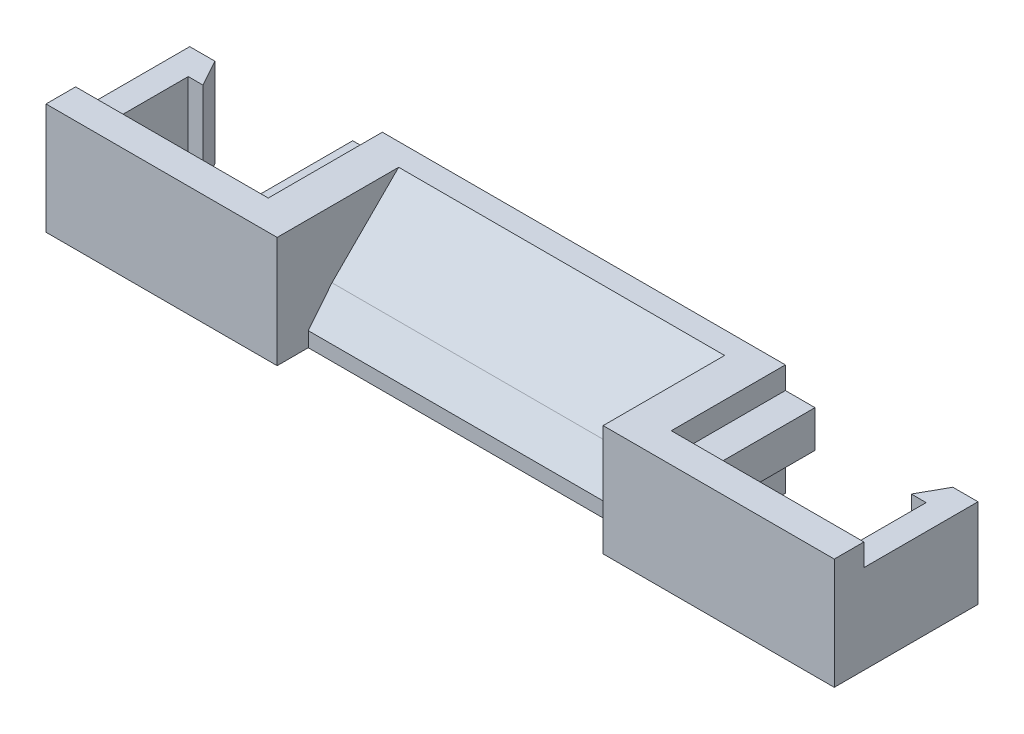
from build123d import *

# Parameters (mm, degrees)
CROQUIS1_W              = 27.2
CROQUIS1_H              = 7.5
SALIENTE_EXTRUIR1_DEPTH = 9.7
CORTAR_EXTRUIR1_DEPTH   = 22
CROQUIS6_W              = 9.7
CROQUIS6_H              = 2.5
SALIENTE_EXTRUIR2_DEPTH = 2
CROQUIS7_W              = 9.7
CROQUIS7_H              = 2.5
SALIENTE_EXTRUIR3_DEPTH = 2
CROQUIS8_W              = 2
CROQUIS8_H              = 7.5
SALIENTE_EXTRUIR4_DEPTH = 13
CROQUIS9_W              = 2
CROQUIS9_H              = 7.5
SALIENTE_EXTRUIR5_DEPTH = 13
CROQUIS11_W             = 1.7
CROQUIS11_H             = 6
SALIENTE_EXTRUIR7_DEPTH = 7.7
SALIENTE_EXTRUIR8_DEPTH = 6


with BuildPart() as part:
    # Croquis1 → Saliente-Extruir1 (new body)
    with BuildSketch(Plane.XY):
        with Locations((13.6, 3.75)):
            Rectangle(CROQUIS1_W, CROQUIS1_H)
    extrude(amount=SALIENTE_EXTRUIR1_DEPTH)

    # Croquis3 → Cortar-Extruir1 (cut)
    with BuildSketch(Plane(origin=(2.6, 0, 0), x_dir=(0, 0, -1), z_dir=(1, 0, 0))):
        Polygon((-7.6, 0), (-7.6, 1), (-6, 3), (-1.5, 7.5), (-1.5, 8.677486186), (-10.793726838, 8.677486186), (-10.793726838, -0.80173334), (-7.6, -0.80173334), align=None)
    extrude(amount=CORTAR_EXTRUIR1_DEPTH, mode=Mode.SUBTRACT)

    # Croquis6 → Saliente-Extruir2 (add)
    with BuildSketch(Plane(origin=(27.2, 0, 0), x_dir=(0, 0, -1), z_dir=(1, 0, 0))):
        with Locations((-4.85, 4.75)):
            Rectangle(CROQUIS6_W, CROQUIS6_H)
    extrude(amount=SALIENTE_EXTRUIR2_DEPTH)

    # Croquis7 → Saliente-Extruir3 (add)
    with BuildSketch(Plane.ZY):
        with Locations((4.85, 4.75)):
            Rectangle(CROQUIS7_W, CROQUIS7_H)
    extrude(amount=SALIENTE_EXTRUIR3_DEPTH)

    # Croquis8 → Saliente-Extruir4 (add)
    with BuildSketch(Plane(origin=(27.2, 0, 0), x_dir=(0, 0, -1), z_dir=(1, 0, 0))):
        with Locations((-8.7, 3.75)):
            Rectangle(CROQUIS8_W, CROQUIS8_H)
    extrude(amount=SALIENTE_EXTRUIR4_DEPTH)

    # Croquis9 → Saliente-Extruir5 (add)
    with BuildSketch(Plane.ZY):
        with Locations((8.7, 3.75)):
            Rectangle(CROQUIS9_W, CROQUIS9_H)
    extrude(amount=SALIENTE_EXTRUIR5_DEPTH)

    # Croquis11 → Saliente-Extruir7 (add)
    with BuildSketch(Plane(origin=(0, 0, 7.7), x_dir=(-1, 0, 0), z_dir=(0, 0, -1))):
        with Locations((-39.35, 3)):
            Rectangle(CROQUIS11_W, CROQUIS11_H)
        with Locations((12.15, 3)):
            Rectangle(CROQUIS11_W, CROQUIS11_H)
    extrude(amount=SALIENTE_EXTRUIR7_DEPTH)

    # Croquis12 → Saliente-Extruir8 (add)
    with BuildSketch(Plane(origin=(0, 6, 0), x_dir=(1, 0, 0), z_dir=(0, 1, 0))):
        Polygon((38.5, 0), (38.5, -1.8), (37.5, -1.8), align=None)
        Polygon((-10.3, -1.8), (-11.3, 0), (-11.3, -1.8), align=None)
    extrude(amount=-SALIENTE_EXTRUIR8_DEPTH)


solid = part.part
